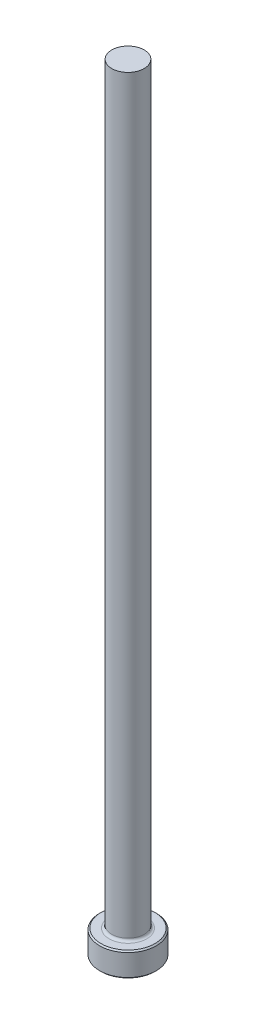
ISO-10303-21;
HEADER;
FILE_DESCRIPTION(('STEP AP214'),'2;1');
FILE_NAME('part.step','',(''),(''),'','','');
FILE_SCHEMA(('AUTOMOTIVE_DESIGN { 1 0 10303 214 1 1 1 1 }'));
ENDSEC;
DATA;
#1=APPLICATION_CONTEXT('core data for automotive mechanical design processes');
#2=APPLICATION_PROTOCOL_DEFINITION('international standard','automotive_design',2000,#1);
#3=PRODUCT_CONTEXT('',#1,'mechanical');
#4=PRODUCT('Part','Part','',(#3));
#5=PRODUCT_RELATED_PRODUCT_CATEGORY('part','',(#4));
#6=PRODUCT_DEFINITION_FORMATION('','',#4);
#7=PRODUCT_DEFINITION_CONTEXT('part definition',#1,'design');
#8=PRODUCT_DEFINITION('design','',#6,#7);
#9=PRODUCT_DEFINITION_SHAPE('','',#8);
#10=(LENGTH_UNIT() NAMED_UNIT(*) SI_UNIT(.MILLI.,.METRE.));
#11=(NAMED_UNIT(*) PLANE_ANGLE_UNIT() SI_UNIT($,.RADIAN.));
#12=(NAMED_UNIT(*) SI_UNIT($,.STERADIAN.) SOLID_ANGLE_UNIT());
#13=UNCERTAINTY_MEASURE_WITH_UNIT(LENGTH_MEASURE(1.E-05),#10,'distance_accuracy_value','');
#14=(GEOMETRIC_REPRESENTATION_CONTEXT(3) GLOBAL_UNCERTAINTY_ASSIGNED_CONTEXT((#13)) GLOBAL_UNIT_ASSIGNED_CONTEXT((#10,
#11,#12)) REPRESENTATION_CONTEXT('',''));
#15=CARTESIAN_POINT('',(0.,0.,0.));
#16=DIRECTION('',(0.,0.,1.));
#17=DIRECTION('',(1.,0.,0.));
#18=AXIS2_PLACEMENT_3D('',#15,#16,#17);
#19=CARTESIAN_POINT('',(0.,0.,0.));
#20=DIRECTION('',(0.,-1.,0.));
#21=DIRECTION('',(0.,0.,-1.));
#22=AXIS2_PLACEMENT_3D('',#19,#20,#21);
#23=PLANE('',#22);
#24=CARTESIAN_POINT('',(0.,0.,0.));
#25=DIRECTION('',(0.,-1.,0.));
#26=DIRECTION('',(0.,0.,-1.));
#27=AXIS2_PLACEMENT_3D('',#24,#25,#26);
#28=CIRCLE('',#27,5.29589999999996);
#29=CARTESIAN_POINT('',(0.,0.,-5.29589999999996));
#30=VERTEX_POINT('',#29);
#31=EDGE_CURVE('E46',#30,#30,#28,.T.);
#32=ORIENTED_EDGE('',*,*,#31,.T.);
#33=EDGE_LOOP('',(#32));
#34=FACE_BOUND('',#33,.T.);
#35=ADVANCED_FACE('F35',(#34),#23,.T.);
#36=CARTESIAN_POINT('',(0.,259.958771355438,0.));
#37=DIRECTION('',(0.,1.,0.));
#38=DIRECTION('',(0.,0.,1.));
#39=AXIS2_PLACEMENT_3D('',#36,#37,#38);
#40=CYLINDRICAL_SURFACE('',#39,5.54989999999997);
#41=CARTESIAN_POINT('',(0.,4.49579999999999,0.));
#42=DIRECTION('',(0.,1.,0.));
#43=DIRECTION('',(0.,0.,1.));
#44=AXIS2_PLACEMENT_3D('',#41,#42,#43);
#45=CIRCLE('',#44,5.54989999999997);
#46=CARTESIAN_POINT('',(0.,4.49579999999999,5.54989999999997));
#47=VERTEX_POINT('',#46);
#48=EDGE_CURVE('E50',#47,#47,#45,.F.);
#49=ORIENTED_EDGE('',*,*,#48,.T.);
#50=EDGE_LOOP('',(#49));
#51=FACE_BOUND('',#50,.T.);
#52=CARTESIAN_POINT('',(0.,0.253999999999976,0.));
#53=DIRECTION('',(0.,-1.,0.));
#54=DIRECTION('',(0.,0.,-1.));
#55=AXIS2_PLACEMENT_3D('',#52,#53,#54);
#56=CIRCLE('',#55,5.54989999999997);
#57=CARTESIAN_POINT('',(0.,0.253999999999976,-5.54989999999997));
#58=VERTEX_POINT('',#57);
#59=EDGE_CURVE('E55',#58,#58,#56,.F.);
#60=ORIENTED_EDGE('',*,*,#59,.T.);
#61=EDGE_LOOP('',(#60));
#62=FACE_BOUND('',#61,.T.);
#63=ADVANCED_FACE('F77',(#51,#62),#40,.T.);
#64=CARTESIAN_POINT('',(-5.54989999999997,4.7498,0.));
#65=DIRECTION('',(0.,1.,0.));
#66=DIRECTION('',(0.,0.,1.));
#67=AXIS2_PLACEMENT_3D('',#64,#65,#66);
#68=PLANE('',#67);
#69=CARTESIAN_POINT('',(0.,4.7498,0.));
#70=DIRECTION('',(0.,1.,0.));
#71=DIRECTION('',(0.,0.,1.));
#72=AXIS2_PLACEMENT_3D('',#69,#70,#71);
#73=CIRCLE('',#72,3.68299999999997);
#74=CARTESIAN_POINT('',(0.,4.7498,3.68299999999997));
#75=VERTEX_POINT('',#74);
#76=EDGE_CURVE('E10',#75,#75,#73,.F.);
#77=ORIENTED_EDGE('',*,*,#76,.T.);
#78=EDGE_LOOP('',(#77));
#79=FACE_BOUND('',#78,.T.);
#80=CARTESIAN_POINT('',(0.,4.7498,0.));
#81=DIRECTION('',(0.,1.,0.));
#82=DIRECTION('',(0.,0.,1.));
#83=AXIS2_PLACEMENT_3D('',#80,#81,#82);
#84=CIRCLE('',#83,5.29589999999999);
#85=CARTESIAN_POINT('',(0.,4.7498,5.29589999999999));
#86=VERTEX_POINT('',#85);
#87=EDGE_CURVE('E58',#86,#86,#84,.T.);
#88=ORIENTED_EDGE('',*,*,#87,.T.);
#89=EDGE_LOOP('',(#88));
#90=FACE_BOUND('',#89,.T.);
#91=ADVANCED_FACE('F69',(#79,#90),#68,.T.);
#92=CARTESIAN_POINT('',(0.,259.958771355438,0.));
#93=DIRECTION('',(0.,1.,0.));
#94=DIRECTION('',(0.,0.,1.));
#95=AXIS2_PLACEMENT_3D('',#92,#93,#94);
#96=CYLINDRICAL_SURFACE('',#95,3.17499999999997);
#97=CARTESIAN_POINT('',(0.,5.25779999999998,0.));
#98=DIRECTION('',(0.,1.,0.));
#99=DIRECTION('',(0.,0.,1.));
#100=AXIS2_PLACEMENT_3D('',#97,#98,#99);
#101=CIRCLE('',#100,3.17499999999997);
#102=CARTESIAN_POINT('',(0.,5.25779999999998,3.17499999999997));
#103=VERTEX_POINT('',#102);
#104=EDGE_CURVE('E42',#103,#103,#101,.T.);
#105=ORIENTED_EDGE('',*,*,#104,.T.);
#106=EDGE_LOOP('',(#105));
#107=FACE_BOUND('',#106,.T.);
#108=CARTESIAN_POINT('',(0.,152.4,0.));
#109=DIRECTION('',(0.,1.,0.));
#110=DIRECTION('',(0.,0.,1.));
#111=AXIS2_PLACEMENT_3D('',#108,#109,#110);
#112=CIRCLE('',#111,3.17499999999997);
#113=CARTESIAN_POINT('',(0.,152.4,3.17499999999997));
#114=VERTEX_POINT('',#113);
#115=EDGE_CURVE('E61',#114,#114,#112,.T.);
#116=ORIENTED_EDGE('',*,*,#115,.F.);
#117=EDGE_LOOP('',(#116));
#118=FACE_BOUND('',#117,.T.);
#119=ADVANCED_FACE('F67',(#107,#118),#96,.T.);
#120=CARTESIAN_POINT('',(-3.17499999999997,152.4,0.));
#121=DIRECTION('',(0.,1.,0.));
#122=DIRECTION('',(0.,0.,1.));
#123=AXIS2_PLACEMENT_3D('',#120,#121,#122);
#124=PLANE('',#123);
#125=ORIENTED_EDGE('',*,*,#115,.T.);
#126=EDGE_LOOP('',(#125));
#127=FACE_BOUND('',#126,.T.);
#128=ADVANCED_FACE('F65',(#127),#124,.T.);
#129=CARTESIAN_POINT('',(0.,4.74980000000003,0.));
#130=DIRECTION('',(0.,-1.,0.));
#131=DIRECTION('',(0.,0.,-1.));
#132=AXIS2_PLACEMENT_3D('',#129,#130,#131);
#133=CONICAL_SURFACE('',#132,5.29589999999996,0.785398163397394);
#134=ORIENTED_EDGE('',*,*,#48,.F.);
#135=EDGE_LOOP('',(#134));
#136=FACE_BOUND('',#135,.T.);
#137=ORIENTED_EDGE('',*,*,#87,.F.);
#138=EDGE_LOOP('',(#137));
#139=FACE_BOUND('',#138,.T.);
#140=ADVANCED_FACE('F75',(#136,#139),#133,.T.);
#141=CARTESIAN_POINT('',(0.,0.253999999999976,0.));
#142=DIRECTION('',(0.,1.,0.));
#143=DIRECTION('',(0.,0.,1.));
#144=AXIS2_PLACEMENT_3D('',#141,#142,#143);
#145=CONICAL_SURFACE('',#144,5.54989999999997,0.785398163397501);
#146=ORIENTED_EDGE('',*,*,#31,.F.);
#147=EDGE_LOOP('',(#146));
#148=FACE_BOUND('',#147,.T.);
#149=ORIENTED_EDGE('',*,*,#59,.F.);
#150=EDGE_LOOP('',(#149));
#151=FACE_BOUND('',#150,.T.);
#152=ADVANCED_FACE('F89',(#148,#151),#145,.T.);
#153=CARTESIAN_POINT('',(0.,5.25779999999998,0.));
#154=DIRECTION('',(0.,1.,0.));
#155=DIRECTION('',(0.,0.,1.));
#156=AXIS2_PLACEMENT_3D('',#153,#154,#155);
#157=TOROIDAL_SURFACE('',#156,3.68299999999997,0.508);
#158=ORIENTED_EDGE('',*,*,#76,.F.);
#159=EDGE_LOOP('',(#158));
#160=FACE_BOUND('',#159,.T.);
#161=ORIENTED_EDGE('',*,*,#104,.F.);
#162=EDGE_LOOP('',(#161));
#163=FACE_BOUND('',#162,.T.);
#164=ADVANCED_FACE('F37',(#160,#163),#157,.F.);
#165=CLOSED_SHELL('',(#35,#63,#91,#119,#128,#140,#152,#164));
#166=MANIFOLD_SOLID_BREP('B2',#165);
#167=ADVANCED_BREP_SHAPE_REPRESENTATION('',(#18,#166),#14);
#168=SHAPE_DEFINITION_REPRESENTATION(#9,#167);
ENDSEC;
END-ISO-10303-21;
